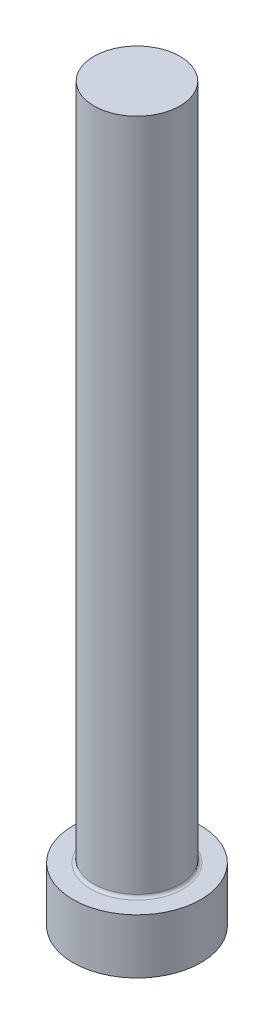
ISO-10303-21;
HEADER;
FILE_DESCRIPTION(('STEP AP214'),'2;1');
FILE_NAME('part.step','',(''),(''),'','','');
FILE_SCHEMA(('AUTOMOTIVE_DESIGN { 1 0 10303 214 1 1 1 1 }'));
ENDSEC;
DATA;
#1=APPLICATION_CONTEXT('core data for automotive mechanical design processes');
#2=APPLICATION_PROTOCOL_DEFINITION('international standard','automotive_design',2000,#1);
#3=PRODUCT_CONTEXT('',#1,'mechanical');
#4=PRODUCT('Part','Part','',(#3));
#5=PRODUCT_RELATED_PRODUCT_CATEGORY('part','',(#4));
#6=PRODUCT_DEFINITION_FORMATION('','',#4);
#7=PRODUCT_DEFINITION_CONTEXT('part definition',#1,'design');
#8=PRODUCT_DEFINITION('design','',#6,#7);
#9=PRODUCT_DEFINITION_SHAPE('','',#8);
#10=(LENGTH_UNIT() NAMED_UNIT(*) SI_UNIT(.MILLI.,.METRE.));
#11=(NAMED_UNIT(*) PLANE_ANGLE_UNIT() SI_UNIT($,.RADIAN.));
#12=(NAMED_UNIT(*) SI_UNIT($,.STERADIAN.) SOLID_ANGLE_UNIT());
#13=UNCERTAINTY_MEASURE_WITH_UNIT(LENGTH_MEASURE(1.E-05),#10,'distance_accuracy_value','');
#14=(GEOMETRIC_REPRESENTATION_CONTEXT(3) GLOBAL_UNCERTAINTY_ASSIGNED_CONTEXT((#13)) GLOBAL_UNIT_ASSIGNED_CONTEXT((#10,
#11,#12)) REPRESENTATION_CONTEXT('',''));
#15=CARTESIAN_POINT('',(0.,0.,0.));
#16=DIRECTION('',(0.,0.,1.));
#17=DIRECTION('',(1.,0.,0.));
#18=AXIS2_PLACEMENT_3D('',#15,#16,#17);
#19=CARTESIAN_POINT('',(0.,63.5,0.));
#20=DIRECTION('',(0.,-1.,0.));
#21=DIRECTION('',(0.,0.,-1.));
#22=AXIS2_PLACEMENT_3D('',#19,#20,#21);
#23=PLANE('',#22);
#24=CARTESIAN_POINT('',(0.,63.5,0.));
#25=DIRECTION('',(0.,1.,0.));
#26=DIRECTION('',(0.,0.,1.));
#27=AXIS2_PLACEMENT_3D('',#24,#25,#26);
#28=CIRCLE('',#27,3.7338);
#29=CARTESIAN_POINT('',(0.,63.5,3.7338));
#30=VERTEX_POINT('',#29);
#31=EDGE_CURVE('E10',#30,#30,#28,.T.);
#32=ORIENTED_EDGE('',*,*,#31,.T.);
#33=EDGE_LOOP('',(#32));
#34=FACE_BOUND('',#33,.T.);
#35=ADVANCED_FACE('F30',(#34),#23,.F.);
#36=CARTESIAN_POINT('',(0.,0.,0.));
#37=DIRECTION('',(0.,1.,0.));
#38=DIRECTION('',(0.,0.,1.));
#39=AXIS2_PLACEMENT_3D('',#36,#37,#38);
#40=CYLINDRICAL_SURFACE('',#39,3.7338);
#41=ORIENTED_EDGE('',*,*,#31,.F.);
#42=EDGE_LOOP('',(#41));
#43=FACE_BOUND('',#42,.T.);
#44=CARTESIAN_POINT('',(0.,5.0038,0.));
#45=DIRECTION('',(0.,1.,0.));
#46=DIRECTION('',(0.,0.,1.));
#47=AXIS2_PLACEMENT_3D('',#44,#45,#46);
#48=CIRCLE('',#47,3.7338);
#49=CARTESIAN_POINT('',(0.,5.0038,3.7338));
#50=VERTEX_POINT('',#49);
#51=EDGE_CURVE('E36',#50,#50,#48,.T.);
#52=ORIENTED_EDGE('',*,*,#51,.T.);
#53=EDGE_LOOP('',(#52));
#54=FACE_BOUND('',#53,.T.);
#55=ADVANCED_FACE('F65',(#43,#54),#40,.T.);
#56=CARTESIAN_POINT('',(0.,5.0038,0.));
#57=DIRECTION('',(0.,1.,0.));
#58=DIRECTION('',(0.,0.,1.));
#59=AXIS2_PLACEMENT_3D('',#56,#57,#58);
#60=TOROIDAL_SURFACE('',#59,3.9878,0.254);
#61=ORIENTED_EDGE('',*,*,#51,.F.);
#62=EDGE_LOOP('',(#61));
#63=FACE_BOUND('',#62,.T.);
#64=CARTESIAN_POINT('',(0.,4.7498,0.));
#65=DIRECTION('',(0.,1.,0.));
#66=DIRECTION('',(0.,0.,1.));
#67=AXIS2_PLACEMENT_3D('',#64,#65,#66);
#68=CIRCLE('',#67,3.9878);
#69=CARTESIAN_POINT('',(0.,4.7498,3.9878));
#70=VERTEX_POINT('',#69);
#71=EDGE_CURVE('E40',#70,#70,#68,.T.);
#72=ORIENTED_EDGE('',*,*,#71,.T.);
#73=EDGE_LOOP('',(#72));
#74=FACE_BOUND('',#73,.T.);
#75=ADVANCED_FACE('F69',(#63,#74),#60,.F.);
#76=CARTESIAN_POINT('',(5.5499,4.7498,0.));
#77=DIRECTION('',(0.,-1.,0.));
#78=DIRECTION('',(0.,0.,-1.));
#79=AXIS2_PLACEMENT_3D('',#76,#77,#78);
#80=PLANE('',#79);
#81=ORIENTED_EDGE('',*,*,#71,.F.);
#82=EDGE_LOOP('',(#81));
#83=FACE_BOUND('',#82,.T.);
#84=CARTESIAN_POINT('',(0.,4.7498,0.));
#85=DIRECTION('',(0.,1.,0.));
#86=DIRECTION('',(0.,0.,1.));
#87=AXIS2_PLACEMENT_3D('',#84,#85,#86);
#88=CIRCLE('',#87,5.5499);
#89=CARTESIAN_POINT('',(0.,4.7498,5.5499));
#90=VERTEX_POINT('',#89);
#91=EDGE_CURVE('E44',#90,#90,#88,.T.);
#92=ORIENTED_EDGE('',*,*,#91,.T.);
#93=EDGE_LOOP('',(#92));
#94=FACE_BOUND('',#93,.T.);
#95=ADVANCED_FACE('F61',(#83,#94),#80,.F.);
#96=CARTESIAN_POINT('',(0.,0.,0.));
#97=DIRECTION('',(0.,1.,0.));
#98=DIRECTION('',(0.,0.,1.));
#99=AXIS2_PLACEMENT_3D('',#96,#97,#98);
#100=CYLINDRICAL_SURFACE('',#99,5.5499);
#101=ORIENTED_EDGE('',*,*,#91,.F.);
#102=EDGE_LOOP('',(#101));
#103=FACE_BOUND('',#102,.T.);
#104=CARTESIAN_POINT('',(0.,0.,0.));
#105=DIRECTION('',(0.,1.,0.));
#106=DIRECTION('',(0.,0.,1.));
#107=AXIS2_PLACEMENT_3D('',#104,#105,#106);
#108=CIRCLE('',#107,5.5499);
#109=CARTESIAN_POINT('',(0.,0.,5.5499));
#110=VERTEX_POINT('',#109);
#111=EDGE_CURVE('E49',#110,#110,#108,.T.);
#112=ORIENTED_EDGE('',*,*,#111,.T.);
#113=EDGE_LOOP('',(#112));
#114=FACE_BOUND('',#113,.T.);
#115=ADVANCED_FACE('F53',(#103,#114),#100,.T.);
#116=CARTESIAN_POINT('',(0.,0.,0.));
#117=DIRECTION('',(0.,1.,0.));
#118=DIRECTION('',(0.,0.,1.));
#119=AXIS2_PLACEMENT_3D('',#116,#117,#118);
#120=PLANE('',#119);
#121=ORIENTED_EDGE('',*,*,#111,.F.);
#122=EDGE_LOOP('',(#121));
#123=FACE_BOUND('',#122,.T.);
#124=ADVANCED_FACE('F55',(#123),#120,.F.);
#125=CLOSED_SHELL('',(#35,#55,#75,#95,#115,#124));
#126=MANIFOLD_SOLID_BREP('B2',#125);
#127=ADVANCED_BREP_SHAPE_REPRESENTATION('',(#18,#126),#14);
#128=SHAPE_DEFINITION_REPRESENTATION(#9,#127);
ENDSEC;
END-ISO-10303-21;
